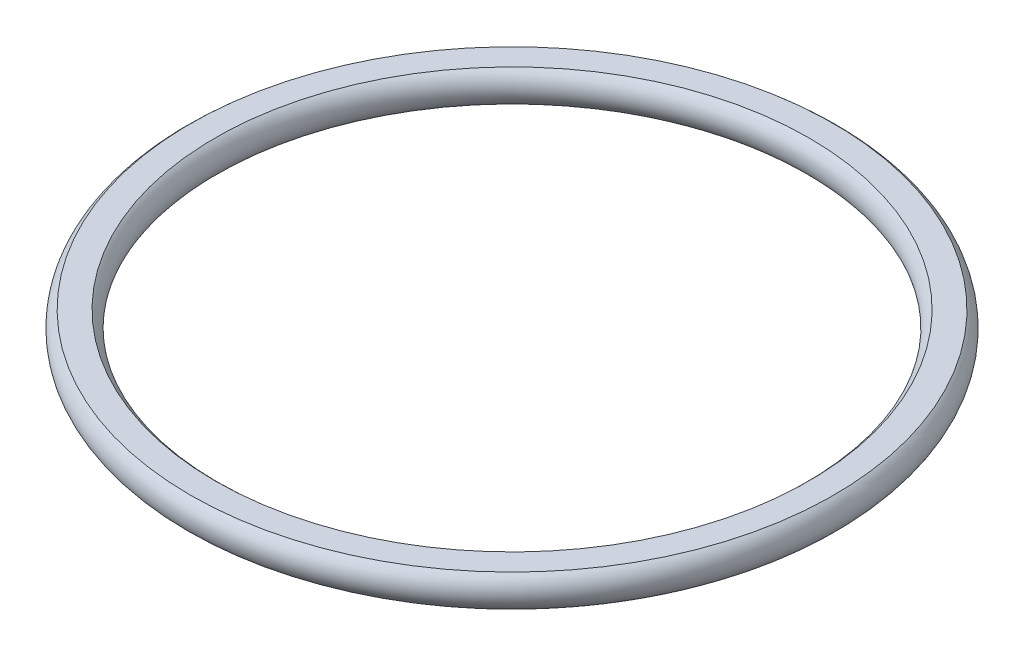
ISO-10303-21;
HEADER;
FILE_DESCRIPTION(('STEP AP214'),'2;1');
FILE_NAME('part.step','',(''),(''),'','','');
FILE_SCHEMA(('AUTOMOTIVE_DESIGN { 1 0 10303 214 1 1 1 1 }'));
ENDSEC;
DATA;
#1=APPLICATION_CONTEXT('core data for automotive mechanical design processes');
#2=APPLICATION_PROTOCOL_DEFINITION('international standard','automotive_design',2000,#1);
#3=PRODUCT_CONTEXT('',#1,'mechanical');
#4=PRODUCT('Part','Part','',(#3));
#5=PRODUCT_RELATED_PRODUCT_CATEGORY('part','',(#4));
#6=PRODUCT_DEFINITION_FORMATION('','',#4);
#7=PRODUCT_DEFINITION_CONTEXT('part definition',#1,'design');
#8=PRODUCT_DEFINITION('design','',#6,#7);
#9=PRODUCT_DEFINITION_SHAPE('','',#8);
#10=(LENGTH_UNIT() NAMED_UNIT(*) SI_UNIT(.MILLI.,.METRE.));
#11=(NAMED_UNIT(*) PLANE_ANGLE_UNIT() SI_UNIT($,.RADIAN.));
#12=(NAMED_UNIT(*) SI_UNIT($,.STERADIAN.) SOLID_ANGLE_UNIT());
#13=UNCERTAINTY_MEASURE_WITH_UNIT(LENGTH_MEASURE(1.E-05),#10,'distance_accuracy_value','');
#14=(GEOMETRIC_REPRESENTATION_CONTEXT(3) GLOBAL_UNCERTAINTY_ASSIGNED_CONTEXT((#13)) GLOBAL_UNIT_ASSIGNED_CONTEXT((#10,
#11,#12)) REPRESENTATION_CONTEXT('',''));
#15=CARTESIAN_POINT('',(0.,0.,0.));
#16=DIRECTION('',(0.,0.,1.));
#17=DIRECTION('',(1.,0.,0.));
#18=AXIS2_PLACEMENT_3D('',#15,#16,#17);
#19=CARTESIAN_POINT('',(0.,10.5915433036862,0.));
#20=DIRECTION('',(0.,1.,0.));
#21=DIRECTION('',(0.,0.,1.));
#22=AXIS2_PLACEMENT_3D('',#19,#20,#21);
#23=TOROIDAL_SURFACE('',#22,26.75,1.75);
#24=CARTESIAN_POINT('',(0.,11.9785369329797,0.));
#25=DIRECTION('',(0.,-1.,0.));
#26=DIRECTION('',(0.,0.,-1.));
#27=AXIS2_PLACEMENT_3D('',#24,#25,#26);
#28=CIRCLE('',#27,25.6828783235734);
#29=CARTESIAN_POINT('',(0.,11.9785369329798,-25.6828783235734));
#30=VERTEX_POINT('',#29);
#31=EDGE_CURVE('E43',#30,#30,#28,.F.);
#32=ORIENTED_EDGE('',*,*,#31,.T.);
#33=EDGE_LOOP('',(#32));
#34=FACE_BOUND('',#33,.T.);
#35=CARTESIAN_POINT('',(0.,11.9785369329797,0.));
#36=DIRECTION('',(0.,1.,0.));
#37=DIRECTION('',(0.,0.,1.));
#38=AXIS2_PLACEMENT_3D('',#35,#36,#37);
#39=CIRCLE('',#38,27.8171216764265);
#40=CARTESIAN_POINT('',(0.,11.9785369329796,27.8171216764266));
#41=VERTEX_POINT('',#40);
#42=EDGE_CURVE('E10',#41,#41,#39,.F.);
#43=ORIENTED_EDGE('',*,*,#42,.T.);
#44=EDGE_LOOP('',(#43));
#45=FACE_BOUND('',#44,.T.);
#46=ADVANCED_FACE('F37',(#34,#45),#23,.T.);
#47=CARTESIAN_POINT('',(0.,11.9785369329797,0.));
#48=DIRECTION('',(0.,1.,0.));
#49=DIRECTION('',(0.,0.,1.));
#50=AXIS2_PLACEMENT_3D('',#47,#48,#49);
#51=PLANE('',#50);
#52=ORIENTED_EDGE('',*,*,#42,.F.);
#53=EDGE_LOOP('',(#52));
#54=FACE_BOUND('',#53,.T.);
#55=ORIENTED_EDGE('',*,*,#31,.F.);
#56=EDGE_LOOP('',(#55));
#57=FACE_BOUND('',#56,.T.);
#58=ADVANCED_FACE('F50',(#54,#57),#51,.T.);
#59=CLOSED_SHELL('',(#46,#58));
#60=MANIFOLD_SOLID_BREP('B2',#59);
#61=ADVANCED_BREP_SHAPE_REPRESENTATION('',(#18,#60),#14);
#62=SHAPE_DEFINITION_REPRESENTATION(#9,#61);
ENDSEC;
END-ISO-10303-21;
